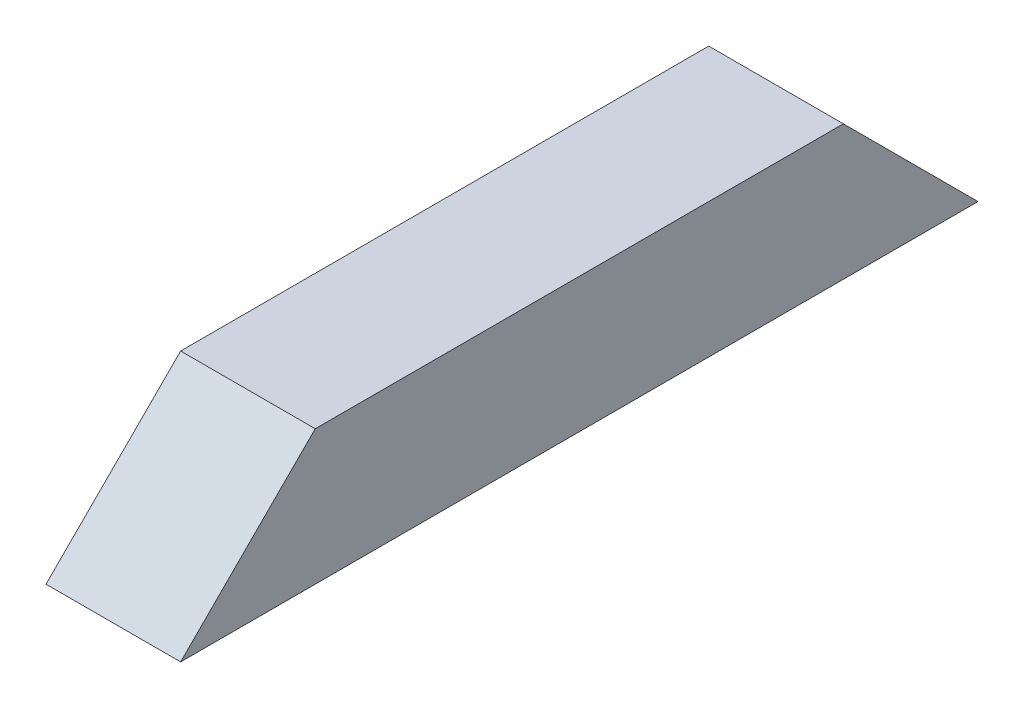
from build123d import *

# Parameters (mm, degrees)
ESQUISSE1_W             = 13
ESQUISSE1_H             = 13
EXTRUSION1_DEPTH        = 38.5
ENL_V_MAT_EXTRU_1_DEPTH = 300


with BuildPart() as part:
    # Esquisse1 → Extrusion1 (new, symmetric)
    with BuildSketch(Plane.XY):
        Rectangle(ESQUISSE1_W, ESQUISSE1_H)
    extrude(amount=EXTRUSION1_DEPTH, both=True)

    # Esquisse2 → Enl_v. mat.-Extru.1 (cut)
    with BuildSketch(Plane(origin=(6.5, 0, 0), x_dir=(0, 0, -1), z_dir=(1, 0, 0))):
        Polygon((-38.5, -6.5), (-25.5, 6.5), (-38.5, 6.5), align=None)
        Polygon((38.5, -6.5), (25.5, 6.5), (38.5, 6.5), align=None)
    extrude(amount=-ENL_V_MAT_EXTRU_1_DEPTH, mode=Mode.SUBTRACT)


solid = part.part
